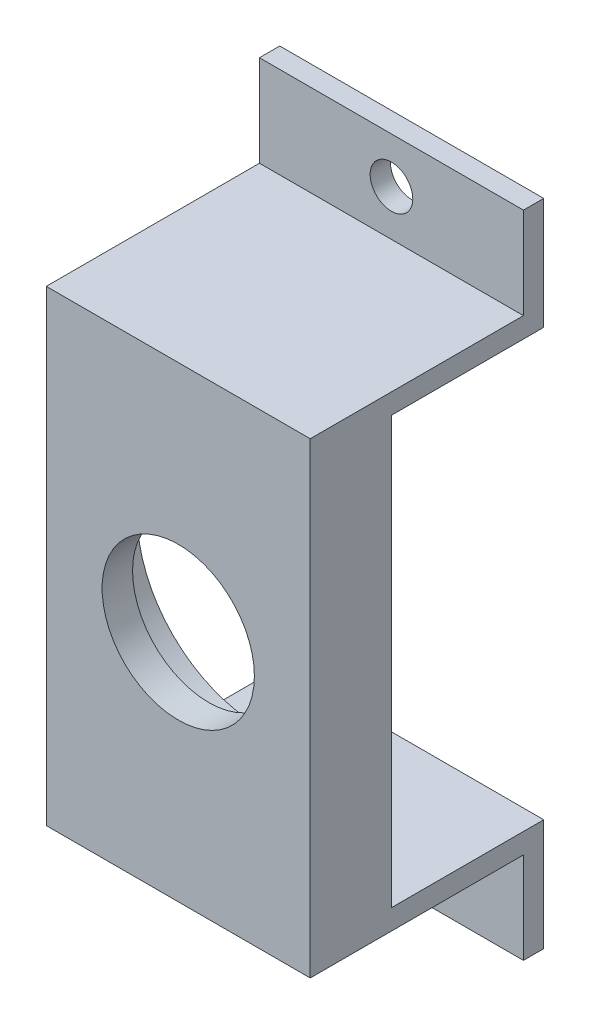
from build123d import *

# Parameters (mm, degrees)
SKETCH_1_W          = 30
SKETCH_1_H          = 61
EXTRUDE_1_DEPTH     = 2
SKETCH_2_R          = 6
CUT_EXTRUDE_1_DEPTH = 2
HOLE_WIZARD_M4_1_D  = 3.3
SKETCH_5_W          = 30
SKETCH_5_H          = 3
EXTRUDE_2_DEPTH     = 15
SKETCH_6_W          = 30
SKETCH_6_H          = 61
EXTRUDE_3_DEPTH     = 8
SKETCH_7_R          = 7.5
CUT_EXTRUDE_2_DEPTH = 8
SKETCH_8_R          = 12.05
CUT_EXTRUDE_3_DEPTH = 5
SKETCH_12_W         = 51.551642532
SKETCH_12_H         = 81.343814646
CUT_EXTRUDE_5_DEPTH = 17
SKETCH_13_W         = 30
SKETCH_13_H         = 8
CUT_EXTRUDE_6_DEPTH = 9.5
SKETCH_14_W         = 30
SKETCH_14_H         = 8
CUT_EXTRUDE_7_DEPTH = 9.5
SKETCH_15_W         = 30
SKETCH_15_H         = 8
EXTRUDE_6_DEPTH     = 2
SKETCH_16_W         = 30
SKETCH_16_H         = 8
EXTRUDE_7_DEPTH     = 2
SKETCH_17_W         = 30
SKETCH_17_H         = 2
EXTRUDE_8_DEPTH     = 15
SKETCH_18_W         = 30
SKETCH_18_H         = 2
EXTRUDE_9_DEPTH     = 9
SKETCH_19_W         = 30
SKETCH_19_H         = 2
EXTRUDE_10_DEPTH    = 9
HOLE_WIZARD_M5_1_D  = 4.2
CUT_EXTRUDE_8_DEPTH = 2
CUT_EXTRUDE_9_DEPTH = 2


with BuildPart() as part:
    # Sketch 1 → Extrude 1 (new body)
    with BuildSketch(Plane.XY):
        Rectangle(SKETCH_1_W, SKETCH_1_H)
    extrude(amount=EXTRUDE_1_DEPTH)

    # Sketch 2 → Cut-Extrude 1 (cut)
    with BuildSketch(Plane.XY.offset(2)):
        Circle(SKETCH_2_R)
    extrude(amount=-CUT_EXTRUDE_1_DEPTH, mode=Mode.SUBTRACT)

    # Hole Wizard M4 _1 (through all)
    with Locations(Plane.XY.offset(2)):
        with Locations((0, 22.5), (0, -22.5)):
            Hole(HOLE_WIZARD_M4_1_D / 2)

    # Sketch 5 → Extrude 2 (add)
    with BuildSketch(Plane.XY.offset(2)):
        with Locations((0, 29)):
            Rectangle(SKETCH_5_W, SKETCH_5_H)
        with Locations((0, -29)):
            Rectangle(SKETCH_5_W, SKETCH_5_H)
    extrude(amount=EXTRUDE_2_DEPTH)

    # Sketch 6 → Extrude 3 (add)
    with BuildSketch(Plane.XY.offset(17)):
        Rectangle(SKETCH_6_W, SKETCH_6_H)
    extrude(amount=EXTRUDE_3_DEPTH)

    # Sketch 7 → Cut-Extrude 2 (cut)
    with BuildSketch(Plane.XY.offset(25)):
        Circle(SKETCH_7_R)
    extrude(amount=-CUT_EXTRUDE_2_DEPTH, mode=Mode.SUBTRACT)

    # Sketch 8 → Cut-Extrude 3 (cut)
    with BuildSketch(Plane(origin=(0, 0, 17), x_dir=(-1, 0, 0), z_dir=(0, 0, -1))):
        Circle(SKETCH_8_R)
    extrude(amount=-CUT_EXTRUDE_3_DEPTH, mode=Mode.SUBTRACT)

    # Sketch 12 → Cut-Extrude 5 (cut)
    with BuildSketch(Plane(origin=(0, 0, 0), x_dir=(-1, 0, 0), z_dir=(0, 0, -1))):
        with Locations((5.948266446, -2.338634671)):
            Rectangle(SKETCH_12_W, SKETCH_12_H)
    extrude(amount=-CUT_EXTRUDE_5_DEPTH, mode=Mode.SUBTRACT)

    # Sketch 13 → Cut-Extrude 6 (cut)
    with BuildSketch(Plane(origin=(0, 30.5, 0), x_dir=(1, 0, 0), z_dir=(0, 1, 0))):
        with Locations((0, -21)):
            Rectangle(SKETCH_13_W, SKETCH_13_H)
    extrude(amount=-CUT_EXTRUDE_6_DEPTH, mode=Mode.SUBTRACT)

    # Sketch 14 → Cut-Extrude 7 (cut)
    with BuildSketch(Plane.XZ.offset(30.5)):
        with Locations((0, 21)):
            Rectangle(SKETCH_14_W, SKETCH_14_H)
    extrude(amount=-CUT_EXTRUDE_7_DEPTH, mode=Mode.SUBTRACT)

    # Sketch 15 → Extrude 6 (add)
    with BuildSketch(Plane.XZ.offset(21)):
        with Locations((0, 21)):
            Rectangle(SKETCH_15_W, SKETCH_15_H)
    extrude(amount=EXTRUDE_6_DEPTH)

    # Sketch 16 → Extrude 7 (add)
    with BuildSketch(Plane(origin=(0, 21, 0), x_dir=(1, 0, 0), z_dir=(0, 1, 0))):
        with Locations((0, -21)):
            Rectangle(SKETCH_16_W, SKETCH_16_H)
    extrude(amount=EXTRUDE_7_DEPTH)

    # Sketch 17 → Extrude 8 (add)
    with BuildSketch(Plane(origin=(0, 0, 17), x_dir=(-1, 0, 0), z_dir=(0, 0, -1))):
        with Locations((0, 22)):
            Rectangle(SKETCH_17_W, SKETCH_17_H)
        with Locations((0, -22)):
            Rectangle(SKETCH_17_W, SKETCH_17_H)
    extrude(amount=EXTRUDE_8_DEPTH)

    # Sketch 18 → Extrude 9 (add)
    with BuildSketch(Plane(origin=(0, 23, 0), x_dir=(1, 0, 0), z_dir=(0, 1, 0))):
        with Locations((0, -3)):
            Rectangle(SKETCH_18_W, SKETCH_18_H)
    extrude(amount=EXTRUDE_9_DEPTH)

    # Sketch 19 → Extrude 10 (add)
    with BuildSketch(Plane.XZ.offset(23)):
        with Locations((0, 3)):
            Rectangle(SKETCH_19_W, SKETCH_19_H)
    extrude(amount=EXTRUDE_10_DEPTH)

    # Hole Wizard M5 _1 (through all)
    with Locations(Plane.XY.offset(4)):
        with Locations((0, 27.5), (0, -27.5)):
            Hole(HOLE_WIZARD_M5_1_D / 2)

    # Sketch 22 → Cut-Extrude 8 (cut)
    with BuildSketch(Plane.ZY.offset(15)):
        Polygon((25, 23), (4, 23), (4, 32), (2, 32), (2, 21), (17, 21), (17, -21), (2, -21), (2, -32), (4, -32), (4, -23), (25, -23), align=None)
    extrude(amount=-CUT_EXTRUDE_8_DEPTH, mode=Mode.SUBTRACT)

    # Sketch 23 → Cut-Extrude 9 (cut)
    with BuildSketch(Plane(origin=(15, 0, 0), x_dir=(0, 0, -1), z_dir=(1, 0, 0))):
        Polygon((-25, 23), (-25, -23), (-4, -23), (-4, -32), (-2, -32), (-2, -21), (-17, -21), (-17, 21), (-2, 21), (-2, 32), (-4, 32), (-4, 23), align=None)
    extrude(amount=-CUT_EXTRUDE_9_DEPTH, mode=Mode.SUBTRACT)


solid = part.part
